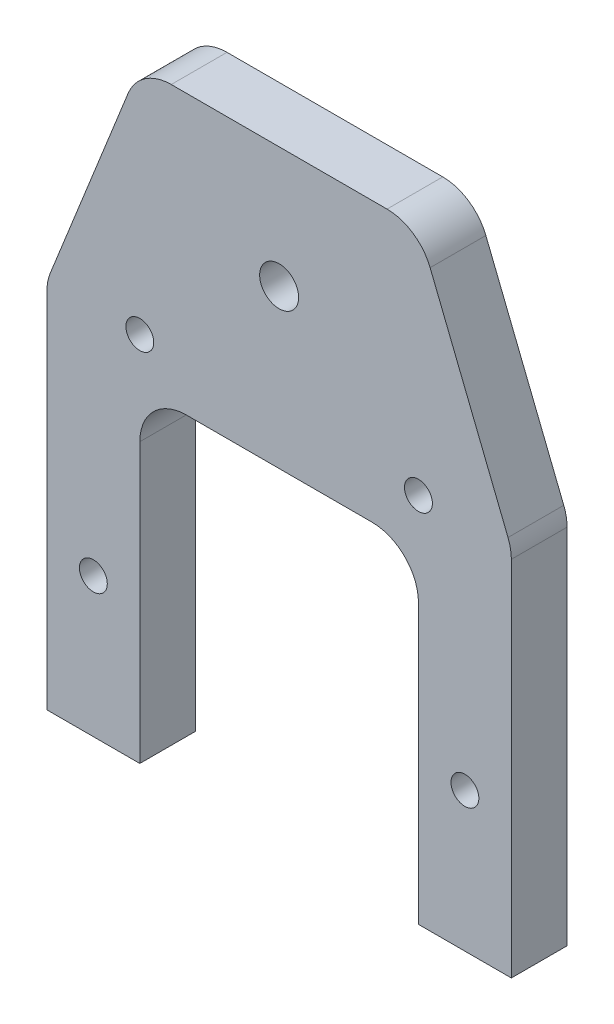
ISO-10303-21;
HEADER;
FILE_DESCRIPTION(('STEP AP214'),'2;1');
FILE_NAME('part.step','',(''),(''),'','','');
FILE_SCHEMA(('AUTOMOTIVE_DESIGN { 1 0 10303 214 1 1 1 1 }'));
ENDSEC;
DATA;
#1=APPLICATION_CONTEXT('core data for automotive mechanical design processes');
#2=APPLICATION_PROTOCOL_DEFINITION('international standard','automotive_design',2000,#1);
#3=PRODUCT_CONTEXT('',#1,'mechanical');
#4=PRODUCT('Part','Part','',(#3));
#5=PRODUCT_RELATED_PRODUCT_CATEGORY('part','',(#4));
#6=PRODUCT_DEFINITION_FORMATION('','',#4);
#7=PRODUCT_DEFINITION_CONTEXT('part definition',#1,'design');
#8=PRODUCT_DEFINITION('design','',#6,#7);
#9=PRODUCT_DEFINITION_SHAPE('','',#8);
#10=(LENGTH_UNIT() NAMED_UNIT(*) SI_UNIT(.MILLI.,.METRE.));
#11=(NAMED_UNIT(*) PLANE_ANGLE_UNIT() SI_UNIT($,.RADIAN.));
#12=(NAMED_UNIT(*) SI_UNIT($,.STERADIAN.) SOLID_ANGLE_UNIT());
#13=UNCERTAINTY_MEASURE_WITH_UNIT(LENGTH_MEASURE(1.E-05),#10,'distance_accuracy_value','');
#14=(GEOMETRIC_REPRESENTATION_CONTEXT(3) GLOBAL_UNCERTAINTY_ASSIGNED_CONTEXT((#13)) GLOBAL_UNIT_ASSIGNED_CONTEXT((#10,
#11,#12)) REPRESENTATION_CONTEXT('',''));
#15=CARTESIAN_POINT('',(0.,0.,0.));
#16=DIRECTION('',(0.,0.,1.));
#17=DIRECTION('',(1.,0.,0.));
#18=AXIS2_PLACEMENT_3D('',#15,#16,#17);
#19=CARTESIAN_POINT('',(50.,0.,6.));
#20=DIRECTION('',(0.,1.,0.));
#21=DIRECTION('',(0.,0.,1.));
#22=AXIS2_PLACEMENT_3D('',#19,#20,#21);
#23=PLANE('',#22);
#24=DIRECTION('',(1.,0.,0.));
#25=VECTOR('',#24,1.);
#26=CARTESIAN_POINT('',(50.,0.,6.));
#27=LINE('',#26,#25);
#28=CARTESIAN_POINT('',(40.,0.,6.));
#29=VERTEX_POINT('',#28);
#30=CARTESIAN_POINT('',(50.,0.,6.));
#31=VERTEX_POINT('',#30);
#32=EDGE_CURVE('E232',#29,#31,#27,.T.);
#33=ORIENTED_EDGE('',*,*,#32,.F.);
#34=DIRECTION('',(0.,0.,-1.));
#35=VECTOR('',#34,1.);
#36=CARTESIAN_POINT('',(40.,0.,6.));
#37=LINE('',#36,#35);
#38=CARTESIAN_POINT('',(40.,0.,0.));
#39=VERTEX_POINT('',#38);
#40=EDGE_CURVE('E156',#29,#39,#37,.T.);
#41=ORIENTED_EDGE('',*,*,#40,.T.);
#42=DIRECTION('',(1.,0.,0.));
#43=VECTOR('',#42,1.);
#44=CARTESIAN_POINT('',(50.,0.,0.));
#45=LINE('',#44,#43);
#46=CARTESIAN_POINT('',(50.,0.,0.));
#47=VERTEX_POINT('',#46);
#48=EDGE_CURVE('E210',#39,#47,#45,.T.);
#49=ORIENTED_EDGE('',*,*,#48,.T.);
#50=DIRECTION('',(0.,0.,-1.));
#51=VECTOR('',#50,1.);
#52=CARTESIAN_POINT('',(50.,0.,6.));
#53=LINE('',#52,#51);
#54=EDGE_CURVE('E279',#31,#47,#53,.T.);
#55=ORIENTED_EDGE('',*,*,#54,.F.);
#56=EDGE_LOOP('',(#33,#41,#49,#55));
#57=FACE_BOUND('',#56,.T.);
#58=ADVANCED_FACE('F26',(#57),#23,.F.);
#59=CARTESIAN_POINT('',(5.,39.0370879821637,6.));
#60=DIRECTION('',(0.,0.,-1.));
#61=DIRECTION('',(-1.,0.,0.));
#62=AXIS2_PLACEMENT_3D('',#59,#60,#61);
#63=PLANE('',#62);
#64=CARTESIAN_POINT('',(45.,15.,6.));
#65=DIRECTION('',(0.,0.,1.));
#66=DIRECTION('',(1.,0.,0.));
#67=AXIS2_PLACEMENT_3D('',#64,#65,#66);
#68=CIRCLE('',#67,1.5);
#69=CARTESIAN_POINT('',(46.5,15.,6.));
#70=VERTEX_POINT('',#69);
#71=EDGE_CURVE('E189',#70,#70,#68,.T.);
#72=ORIENTED_EDGE('',*,*,#71,.F.);
#73=EDGE_LOOP('',(#72));
#74=FACE_BOUND('',#73,.T.);
#75=CARTESIAN_POINT('',(40.,40.,6.));
#76=DIRECTION('',(0.,0.,1.));
#77=DIRECTION('',(1.,0.,0.));
#78=AXIS2_PLACEMENT_3D('',#75,#76,#77);
#79=CIRCLE('',#78,1.5);
#80=CARTESIAN_POINT('',(41.5,40.,6.));
#81=VERTEX_POINT('',#80);
#82=EDGE_CURVE('E201',#81,#81,#79,.T.);
#83=ORIENTED_EDGE('',*,*,#82,.F.);
#84=EDGE_LOOP('',(#83));
#85=FACE_BOUND('',#84,.T.);
#86=CARTESIAN_POINT('',(35.,30.,6.));
#87=DIRECTION('',(0.,0.,1.));
#88=DIRECTION('',(-1.,0.,0.));
#89=AXIS2_PLACEMENT_3D('',#86,#87,#88);
#90=CIRCLE('',#89,5.);
#91=CARTESIAN_POINT('',(40.,30.,6.));
#92=VERTEX_POINT('',#91);
#93=CARTESIAN_POINT('',(35.,35.,6.));
#94=VERTEX_POINT('',#93);
#95=EDGE_CURVE('E144',#92,#94,#90,.T.);
#96=ORIENTED_EDGE('',*,*,#95,.F.);
#97=DIRECTION('',(0.,1.,0.));
#98=VECTOR('',#97,1.);
#99=CARTESIAN_POINT('',(40.,30.,6.));
#100=LINE('',#99,#98);
#101=EDGE_CURVE('E153',#29,#92,#100,.T.);
#102=ORIENTED_EDGE('',*,*,#101,.F.);
#103=ORIENTED_EDGE('',*,*,#32,.T.);
#104=DIRECTION('',(0.,1.,0.));
#105=VECTOR('',#104,1.);
#106=CARTESIAN_POINT('',(50.,39.0370879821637,6.));
#107=LINE('',#106,#105);
#108=CARTESIAN_POINT('',(50.,39.0370879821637,6.));
#109=VERTEX_POINT('',#108);
#110=EDGE_CURVE('E235',#31,#109,#107,.T.);
#111=ORIENTED_EDGE('',*,*,#110,.T.);
#112=CARTESIAN_POINT('',(45.,39.0370879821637,6.));
#113=DIRECTION('',(0.,0.,1.));
#114=DIRECTION('',(-1.,0.,0.));
#115=AXIS2_PLACEMENT_3D('',#112,#113,#114);
#116=CIRCLE('',#115,5.);
#117=CARTESIAN_POINT('',(49.6423834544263,40.8940413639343,6.));
#118=VERTEX_POINT('',#117);
#119=EDGE_CURVE('E237',#109,#118,#116,.T.);
#120=ORIENTED_EDGE('',*,*,#119,.T.);
#121=DIRECTION('',(-0.371390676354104,0.928476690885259,0.));
#122=VECTOR('',#121,1.);
#123=CARTESIAN_POINT('',(41.2572186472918,61.8569533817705,6.));
#124=LINE('',#123,#122);
#125=CARTESIAN_POINT('',(41.2572186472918,61.8569533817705,6.));
#126=VERTEX_POINT('',#125);
#127=EDGE_CURVE('E239',#118,#126,#124,.T.);
#128=ORIENTED_EDGE('',*,*,#127,.T.);
#129=CARTESIAN_POINT('',(36.6148351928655,60.,6.));
#130=DIRECTION('',(0.,0.,1.));
#131=DIRECTION('',(-1.,0.,0.));
#132=AXIS2_PLACEMENT_3D('',#129,#130,#131);
#133=CIRCLE('',#132,5.);
#134=CARTESIAN_POINT('',(36.6148351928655,65.,6.));
#135=VERTEX_POINT('',#134);
#136=EDGE_CURVE('E241',#126,#135,#133,.T.);
#137=ORIENTED_EDGE('',*,*,#136,.T.);
#138=DIRECTION('',(-1.,0.,0.));
#139=VECTOR('',#138,1.);
#140=CARTESIAN_POINT('',(13.3851648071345,65.,6.));
#141=LINE('',#140,#139);
#142=CARTESIAN_POINT('',(13.3851648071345,65.,6.));
#143=VERTEX_POINT('',#142);
#144=EDGE_CURVE('E243',#135,#143,#141,.T.);
#145=ORIENTED_EDGE('',*,*,#144,.T.);
#146=CARTESIAN_POINT('',(13.3851648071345,60.,6.));
#147=DIRECTION('',(0.,0.,1.));
#148=DIRECTION('',(-1.,0.,0.));
#149=AXIS2_PLACEMENT_3D('',#146,#147,#148);
#150=CIRCLE('',#149,5.);
#151=CARTESIAN_POINT('',(8.7427813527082,61.8569533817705,6.));
#152=VERTEX_POINT('',#151);
#153=EDGE_CURVE('E245',#143,#152,#150,.T.);
#154=ORIENTED_EDGE('',*,*,#153,.T.);
#155=DIRECTION('',(-0.371390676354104,-0.928476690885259,0.));
#156=VECTOR('',#155,1.);
#157=CARTESIAN_POINT('',(0.35761654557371,40.8940413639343,6.));
#158=LINE('',#157,#156);
#159=CARTESIAN_POINT('',(0.357616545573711,40.8940413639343,6.));
#160=VERTEX_POINT('',#159);
#161=EDGE_CURVE('E247',#152,#160,#158,.T.);
#162=ORIENTED_EDGE('',*,*,#161,.T.);
#163=CARTESIAN_POINT('',(5.,39.0370879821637,6.));
#164=DIRECTION('',(0.,0.,1.));
#165=DIRECTION('',(-1.,0.,0.));
#166=AXIS2_PLACEMENT_3D('',#163,#164,#165);
#167=CIRCLE('',#166,5.);
#168=CARTESIAN_POINT('',(0.,39.0370879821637,6.));
#169=VERTEX_POINT('',#168);
#170=EDGE_CURVE('E249',#160,#169,#167,.T.);
#171=ORIENTED_EDGE('',*,*,#170,.T.);
#172=DIRECTION('',(0.,-1.,0.));
#173=VECTOR('',#172,1.);
#174=CARTESIAN_POINT('',(0.,0.,6.));
#175=LINE('',#174,#173);
#176=CARTESIAN_POINT('',(0.,0.,6.));
#177=VERTEX_POINT('',#176);
#178=EDGE_CURVE('E49',#169,#177,#175,.T.);
#179=ORIENTED_EDGE('',*,*,#178,.T.);
#180=CARTESIAN_POINT('',(10.,0.,6.));
#181=VERTEX_POINT('',#180);
#182=EDGE_CURVE('E233',#177,#181,#27,.T.);
#183=ORIENTED_EDGE('',*,*,#182,.T.);
#184=DIRECTION('',(0.,-1.,0.));
#185=VECTOR('',#184,1.);
#186=CARTESIAN_POINT('',(10.,30.,6.));
#187=LINE('',#186,#185);
#188=CARTESIAN_POINT('',(10.,30.,6.));
#189=VERTEX_POINT('',#188);
#190=EDGE_CURVE('E41',#189,#181,#187,.T.);
#191=ORIENTED_EDGE('',*,*,#190,.F.);
#192=CARTESIAN_POINT('',(15.,30.,6.));
#193=DIRECTION('',(0.,0.,1.));
#194=DIRECTION('',(1.,0.,0.));
#195=AXIS2_PLACEMENT_3D('',#192,#193,#194);
#196=CIRCLE('',#195,5.);
#197=CARTESIAN_POINT('',(15.,35.,6.));
#198=VERTEX_POINT('',#197);
#199=EDGE_CURVE('E165',#198,#189,#196,.T.);
#200=ORIENTED_EDGE('',*,*,#199,.F.);
#201=DIRECTION('',(-1.,0.,0.));
#202=VECTOR('',#201,1.);
#203=CARTESIAN_POINT('',(15.,35.,6.));
#204=LINE('',#203,#202);
#205=EDGE_CURVE('E163',#94,#198,#204,.T.);
#206=ORIENTED_EDGE('',*,*,#205,.F.);
#207=EDGE_LOOP('',(#96,#102,#103,#111,#120,#128,#137,#145,#154,#162,#171,#179,#183,#191,#200,#206));
#208=FACE_BOUND('',#207,.T.);
#209=CARTESIAN_POINT('',(10.,40.,6.));
#210=DIRECTION('',(0.,0.,1.));
#211=DIRECTION('',(1.,0.,0.));
#212=AXIS2_PLACEMENT_3D('',#209,#210,#211);
#213=CIRCLE('',#212,1.5);
#214=CARTESIAN_POINT('',(11.5,40.,6.));
#215=VERTEX_POINT('',#214);
#216=EDGE_CURVE('E207',#215,#215,#213,.T.);
#217=ORIENTED_EDGE('',*,*,#216,.F.);
#218=EDGE_LOOP('',(#217));
#219=FACE_BOUND('',#218,.T.);
#220=CARTESIAN_POINT('',(5.,15.,6.));
#221=DIRECTION('',(0.,0.,1.));
#222=DIRECTION('',(1.,0.,0.));
#223=AXIS2_PLACEMENT_3D('',#220,#221,#222);
#224=CIRCLE('',#223,1.5);
#225=CARTESIAN_POINT('',(6.5,15.,6.));
#226=VERTEX_POINT('',#225);
#227=EDGE_CURVE('E195',#226,#226,#224,.T.);
#228=ORIENTED_EDGE('',*,*,#227,.F.);
#229=EDGE_LOOP('',(#228));
#230=FACE_BOUND('',#229,.T.);
#231=CARTESIAN_POINT('',(25.,52.,6.));
#232=DIRECTION('',(0.,0.,1.));
#233=DIRECTION('',(1.,0.,0.));
#234=AXIS2_PLACEMENT_3D('',#231,#232,#233);
#235=CIRCLE('',#234,2.1);
#236=CARTESIAN_POINT('',(27.1,52.,6.));
#237=VERTEX_POINT('',#236);
#238=EDGE_CURVE('E183',#237,#237,#235,.T.);
#239=ORIENTED_EDGE('',*,*,#238,.F.);
#240=EDGE_LOOP('',(#239));
#241=FACE_BOUND('',#240,.T.);
#242=ADVANCED_FACE('F159',(#74,#85,#208,#219,#230,#241),#63,.F.);
#243=CARTESIAN_POINT('',(5.,39.0370879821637,0.));
#244=DIRECTION('',(0.,0.,-1.));
#245=DIRECTION('',(-1.,0.,0.));
#246=AXIS2_PLACEMENT_3D('',#243,#244,#245);
#247=PLANE('',#246);
#248=DIRECTION('',(0.,-1.,0.));
#249=VECTOR('',#248,1.);
#250=CARTESIAN_POINT('',(40.,39.0370879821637,0.));
#251=LINE('',#250,#249);
#252=CARTESIAN_POINT('',(40.,30.,0.));
#253=VERTEX_POINT('',#252);
#254=EDGE_CURVE('E178',#253,#39,#251,.T.);
#255=ORIENTED_EDGE('',*,*,#254,.F.);
#256=CARTESIAN_POINT('',(35.,30.,0.));
#257=DIRECTION('',(0.,0.,-1.));
#258=DIRECTION('',(-1.,0.,0.));
#259=AXIS2_PLACEMENT_3D('',#256,#257,#258);
#260=CIRCLE('',#259,5.);
#261=CARTESIAN_POINT('',(35.,35.,0.));
#262=VERTEX_POINT('',#261);
#263=EDGE_CURVE('E147',#262,#253,#260,.T.);
#264=ORIENTED_EDGE('',*,*,#263,.F.);
#265=DIRECTION('',(1.,0.,0.));
#266=VECTOR('',#265,1.);
#267=CARTESIAN_POINT('',(5.,35.,0.));
#268=LINE('',#267,#266);
#269=CARTESIAN_POINT('',(15.,35.,0.));
#270=VERTEX_POINT('',#269);
#271=EDGE_CURVE('E34',#270,#262,#268,.T.);
#272=ORIENTED_EDGE('',*,*,#271,.F.);
#273=CARTESIAN_POINT('',(15.,30.,0.));
#274=DIRECTION('',(0.,0.,-1.));
#275=DIRECTION('',(-1.,0.,0.));
#276=AXIS2_PLACEMENT_3D('',#273,#274,#275);
#277=CIRCLE('',#276,5.);
#278=CARTESIAN_POINT('',(10.,30.,0.));
#279=VERTEX_POINT('',#278);
#280=EDGE_CURVE('E11',#279,#270,#277,.T.);
#281=ORIENTED_EDGE('',*,*,#280,.F.);
#282=DIRECTION('',(0.,1.,0.));
#283=VECTOR('',#282,1.);
#284=CARTESIAN_POINT('',(10.,39.0370879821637,0.));
#285=LINE('',#284,#283);
#286=CARTESIAN_POINT('',(10.,0.,0.));
#287=VERTEX_POINT('',#286);
#288=EDGE_CURVE('E173',#287,#279,#285,.T.);
#289=ORIENTED_EDGE('',*,*,#288,.F.);
#290=CARTESIAN_POINT('',(0.,0.,0.));
#291=VERTEX_POINT('',#290);
#292=EDGE_CURVE('E211',#291,#287,#45,.T.);
#293=ORIENTED_EDGE('',*,*,#292,.F.);
#294=DIRECTION('',(0.,-1.,0.));
#295=VECTOR('',#294,1.);
#296=CARTESIAN_POINT('',(0.,0.,0.));
#297=LINE('',#296,#295);
#298=CARTESIAN_POINT('',(0.,39.0370879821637,0.));
#299=VERTEX_POINT('',#298);
#300=EDGE_CURVE('E230',#299,#291,#297,.T.);
#301=ORIENTED_EDGE('',*,*,#300,.F.);
#302=CARTESIAN_POINT('',(5.,39.0370879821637,0.));
#303=DIRECTION('',(0.,0.,1.));
#304=DIRECTION('',(-1.,0.,0.));
#305=AXIS2_PLACEMENT_3D('',#302,#303,#304);
#306=CIRCLE('',#305,5.);
#307=CARTESIAN_POINT('',(0.357616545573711,40.8940413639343,0.));
#308=VERTEX_POINT('',#307);
#309=EDGE_CURVE('E228',#308,#299,#306,.T.);
#310=ORIENTED_EDGE('',*,*,#309,.F.);
#311=DIRECTION('',(-0.371390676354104,-0.928476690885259,0.));
#312=VECTOR('',#311,1.);
#313=CARTESIAN_POINT('',(0.35761654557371,40.8940413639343,0.));
#314=LINE('',#313,#312);
#315=CARTESIAN_POINT('',(8.7427813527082,61.8569533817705,0.));
#316=VERTEX_POINT('',#315);
#317=EDGE_CURVE('E226',#316,#308,#314,.T.);
#318=ORIENTED_EDGE('',*,*,#317,.F.);
#319=CARTESIAN_POINT('',(13.3851648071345,60.,0.));
#320=DIRECTION('',(0.,0.,1.));
#321=DIRECTION('',(-1.,0.,0.));
#322=AXIS2_PLACEMENT_3D('',#319,#320,#321);
#323=CIRCLE('',#322,5.);
#324=CARTESIAN_POINT('',(13.3851648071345,65.,0.));
#325=VERTEX_POINT('',#324);
#326=EDGE_CURVE('E224',#325,#316,#323,.T.);
#327=ORIENTED_EDGE('',*,*,#326,.F.);
#328=DIRECTION('',(-1.,0.,0.));
#329=VECTOR('',#328,1.);
#330=CARTESIAN_POINT('',(13.3851648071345,65.,0.));
#331=LINE('',#330,#329);
#332=CARTESIAN_POINT('',(36.6148351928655,65.,0.));
#333=VERTEX_POINT('',#332);
#334=EDGE_CURVE('E222',#333,#325,#331,.T.);
#335=ORIENTED_EDGE('',*,*,#334,.F.);
#336=CARTESIAN_POINT('',(36.6148351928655,60.,0.));
#337=DIRECTION('',(0.,0.,1.));
#338=DIRECTION('',(-1.,0.,0.));
#339=AXIS2_PLACEMENT_3D('',#336,#337,#338);
#340=CIRCLE('',#339,5.);
#341=CARTESIAN_POINT('',(41.2572186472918,61.8569533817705,0.));
#342=VERTEX_POINT('',#341);
#343=EDGE_CURVE('E220',#342,#333,#340,.T.);
#344=ORIENTED_EDGE('',*,*,#343,.F.);
#345=DIRECTION('',(-0.371390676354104,0.928476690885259,0.));
#346=VECTOR('',#345,1.);
#347=CARTESIAN_POINT('',(41.2572186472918,61.8569533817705,0.));
#348=LINE('',#347,#346);
#349=CARTESIAN_POINT('',(49.6423834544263,40.8940413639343,0.));
#350=VERTEX_POINT('',#349);
#351=EDGE_CURVE('E218',#350,#342,#348,.T.);
#352=ORIENTED_EDGE('',*,*,#351,.F.);
#353=CARTESIAN_POINT('',(45.,39.0370879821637,0.));
#354=DIRECTION('',(0.,0.,1.));
#355=DIRECTION('',(-1.,0.,0.));
#356=AXIS2_PLACEMENT_3D('',#353,#354,#355);
#357=CIRCLE('',#356,5.);
#358=CARTESIAN_POINT('',(50.,39.0370879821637,0.));
#359=VERTEX_POINT('',#358);
#360=EDGE_CURVE('E216',#359,#350,#357,.T.);
#361=ORIENTED_EDGE('',*,*,#360,.F.);
#362=DIRECTION('',(0.,1.,0.));
#363=VECTOR('',#362,1.);
#364=CARTESIAN_POINT('',(50.,39.0370879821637,0.));
#365=LINE('',#364,#363);
#366=EDGE_CURVE('E214',#47,#359,#365,.T.);
#367=ORIENTED_EDGE('',*,*,#366,.F.);
#368=ORIENTED_EDGE('',*,*,#48,.F.);
#369=EDGE_LOOP('',(#255,#264,#272,#281,#289,#293,#301,#310,#318,#327,#335,#344,#352,#361,#367,#368));
#370=FACE_BOUND('',#369,.T.);
#371=CARTESIAN_POINT('',(45.,15.,0.));
#372=DIRECTION('',(0.,0.,1.));
#373=DIRECTION('',(1.,0.,0.));
#374=AXIS2_PLACEMENT_3D('',#371,#372,#373);
#375=CIRCLE('',#374,1.5);
#376=CARTESIAN_POINT('',(46.5,15.,0.));
#377=VERTEX_POINT('',#376);
#378=EDGE_CURVE('E186',#377,#377,#375,.T.);
#379=ORIENTED_EDGE('',*,*,#378,.T.);
#380=EDGE_LOOP('',(#379));
#381=FACE_BOUND('',#380,.T.);
#382=CARTESIAN_POINT('',(40.,40.,0.));
#383=DIRECTION('',(0.,0.,1.));
#384=DIRECTION('',(1.,0.,0.));
#385=AXIS2_PLACEMENT_3D('',#382,#383,#384);
#386=CIRCLE('',#385,1.5);
#387=CARTESIAN_POINT('',(41.5,40.,0.));
#388=VERTEX_POINT('',#387);
#389=EDGE_CURVE('E198',#388,#388,#386,.T.);
#390=ORIENTED_EDGE('',*,*,#389,.T.);
#391=EDGE_LOOP('',(#390));
#392=FACE_BOUND('',#391,.T.);
#393=CARTESIAN_POINT('',(10.,40.,0.));
#394=DIRECTION('',(0.,0.,1.));
#395=DIRECTION('',(1.,0.,0.));
#396=AXIS2_PLACEMENT_3D('',#393,#394,#395);
#397=CIRCLE('',#396,1.5);
#398=CARTESIAN_POINT('',(11.5,40.,0.));
#399=VERTEX_POINT('',#398);
#400=EDGE_CURVE('E204',#399,#399,#397,.T.);
#401=ORIENTED_EDGE('',*,*,#400,.T.);
#402=EDGE_LOOP('',(#401));
#403=FACE_BOUND('',#402,.T.);
#404=CARTESIAN_POINT('',(5.,15.,0.));
#405=DIRECTION('',(0.,0.,1.));
#406=DIRECTION('',(1.,0.,0.));
#407=AXIS2_PLACEMENT_3D('',#404,#405,#406);
#408=CIRCLE('',#407,1.5);
#409=CARTESIAN_POINT('',(6.5,15.,0.));
#410=VERTEX_POINT('',#409);
#411=EDGE_CURVE('E192',#410,#410,#408,.T.);
#412=ORIENTED_EDGE('',*,*,#411,.T.);
#413=EDGE_LOOP('',(#412));
#414=FACE_BOUND('',#413,.T.);
#415=CARTESIAN_POINT('',(25.,52.,0.));
#416=DIRECTION('',(0.,0.,1.));
#417=DIRECTION('',(1.,0.,0.));
#418=AXIS2_PLACEMENT_3D('',#415,#416,#417);
#419=CIRCLE('',#418,2.1);
#420=CARTESIAN_POINT('',(27.1,52.,0.));
#421=VERTEX_POINT('',#420);
#422=EDGE_CURVE('E180',#421,#421,#419,.T.);
#423=ORIENTED_EDGE('',*,*,#422,.T.);
#424=EDGE_LOOP('',(#423));
#425=FACE_BOUND('',#424,.T.);
#426=ADVANCED_FACE('F291',(#370,#381,#392,#403,#414,#425),#247,.T.);
#427=ORIENTED_EDGE('',*,*,#292,.T.);
#428=DIRECTION('',(0.,0.,1.));
#429=VECTOR('',#428,1.);
#430=CARTESIAN_POINT('',(10.,0.,6.));
#431=LINE('',#430,#429);
#432=EDGE_CURVE('E282',#287,#181,#431,.T.);
#433=ORIENTED_EDGE('',*,*,#432,.T.);
#434=ORIENTED_EDGE('',*,*,#182,.F.);
#435=DIRECTION('',(0.,0.,-1.));
#436=VECTOR('',#435,1.);
#437=CARTESIAN_POINT('',(0.,0.,6.));
#438=LINE('',#437,#436);
#439=EDGE_CURVE('E252',#177,#291,#438,.T.);
#440=ORIENTED_EDGE('',*,*,#439,.T.);
#441=EDGE_LOOP('',(#427,#433,#434,#440));
#442=FACE_BOUND('',#441,.T.);
#443=ADVANCED_FACE('F28',(#442),#23,.F.);
#444=CARTESIAN_POINT('',(50.,39.0370879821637,6.));
#445=DIRECTION('',(-1.,0.,0.));
#446=DIRECTION('',(0.,0.,1.));
#447=AXIS2_PLACEMENT_3D('',#444,#445,#446);
#448=PLANE('',#447);
#449=ORIENTED_EDGE('',*,*,#366,.T.);
#450=DIRECTION('',(0.,0.,-1.));
#451=VECTOR('',#450,1.);
#452=CARTESIAN_POINT('',(50.,39.0370879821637,6.));
#453=LINE('',#452,#451);
#454=EDGE_CURVE('E276',#109,#359,#453,.T.);
#455=ORIENTED_EDGE('',*,*,#454,.F.);
#456=ORIENTED_EDGE('',*,*,#110,.F.);
#457=ORIENTED_EDGE('',*,*,#54,.T.);
#458=EDGE_LOOP('',(#449,#455,#456,#457));
#459=FACE_BOUND('',#458,.T.);
#460=ADVANCED_FACE('F300',(#459),#448,.F.);
#461=CARTESIAN_POINT('',(45.,39.0370879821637,6.));
#462=DIRECTION('',(0.,0.,-1.));
#463=DIRECTION('',(-1.,0.,0.));
#464=AXIS2_PLACEMENT_3D('',#461,#462,#463);
#465=CYLINDRICAL_SURFACE('',#464,5.);
#466=ORIENTED_EDGE('',*,*,#360,.T.);
#467=DIRECTION('',(0.,0.,-1.));
#468=VECTOR('',#467,1.);
#469=CARTESIAN_POINT('',(49.6423834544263,40.8940413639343,6.));
#470=LINE('',#469,#468);
#471=EDGE_CURVE('E273',#118,#350,#470,.T.);
#472=ORIENTED_EDGE('',*,*,#471,.F.);
#473=ORIENTED_EDGE('',*,*,#119,.F.);
#474=ORIENTED_EDGE('',*,*,#454,.T.);
#475=EDGE_LOOP('',(#466,#472,#473,#474));
#476=FACE_BOUND('',#475,.T.);
#477=ADVANCED_FACE('F305',(#476),#465,.T.);
#478=CARTESIAN_POINT('',(41.2572186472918,61.8569533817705,6.));
#479=DIRECTION('',(-0.928476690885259,-0.371390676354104,0.));
#480=DIRECTION('',(0.371390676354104,-0.928476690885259,0.));
#481=AXIS2_PLACEMENT_3D('',#478,#479,#480);
#482=PLANE('',#481);
#483=ORIENTED_EDGE('',*,*,#351,.T.);
#484=DIRECTION('',(0.,0.,-1.));
#485=VECTOR('',#484,1.);
#486=CARTESIAN_POINT('',(41.2572186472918,61.8569533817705,6.));
#487=LINE('',#486,#485);
#488=EDGE_CURVE('E270',#126,#342,#487,.T.);
#489=ORIENTED_EDGE('',*,*,#488,.F.);
#490=ORIENTED_EDGE('',*,*,#127,.F.);
#491=ORIENTED_EDGE('',*,*,#471,.T.);
#492=EDGE_LOOP('',(#483,#489,#490,#491));
#493=FACE_BOUND('',#492,.T.);
#494=ADVANCED_FACE('F311',(#493),#482,.F.);
#495=CARTESIAN_POINT('',(36.6148351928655,60.,6.));
#496=DIRECTION('',(0.,0.,-1.));
#497=DIRECTION('',(-1.,0.,0.));
#498=AXIS2_PLACEMENT_3D('',#495,#496,#497);
#499=CYLINDRICAL_SURFACE('',#498,5.);
#500=ORIENTED_EDGE('',*,*,#343,.T.);
#501=DIRECTION('',(0.,0.,-1.));
#502=VECTOR('',#501,1.);
#503=CARTESIAN_POINT('',(36.6148351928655,65.,6.));
#504=LINE('',#503,#502);
#505=EDGE_CURVE('E267',#135,#333,#504,.T.);
#506=ORIENTED_EDGE('',*,*,#505,.F.);
#507=ORIENTED_EDGE('',*,*,#136,.F.);
#508=ORIENTED_EDGE('',*,*,#488,.T.);
#509=EDGE_LOOP('',(#500,#506,#507,#508));
#510=FACE_BOUND('',#509,.T.);
#511=ADVANCED_FACE('F315',(#510),#499,.T.);
#512=CARTESIAN_POINT('',(13.3851648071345,65.,6.));
#513=DIRECTION('',(0.,-1.,0.));
#514=DIRECTION('',(0.,0.,-1.));
#515=AXIS2_PLACEMENT_3D('',#512,#513,#514);
#516=PLANE('',#515);
#517=ORIENTED_EDGE('',*,*,#334,.T.);
#518=DIRECTION('',(0.,0.,-1.));
#519=VECTOR('',#518,1.);
#520=CARTESIAN_POINT('',(13.3851648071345,65.,6.));
#521=LINE('',#520,#519);
#522=EDGE_CURVE('E264',#143,#325,#521,.T.);
#523=ORIENTED_EDGE('',*,*,#522,.F.);
#524=ORIENTED_EDGE('',*,*,#144,.F.);
#525=ORIENTED_EDGE('',*,*,#505,.T.);
#526=EDGE_LOOP('',(#517,#523,#524,#525));
#527=FACE_BOUND('',#526,.T.);
#528=ADVANCED_FACE('F320',(#527),#516,.F.);
#529=CARTESIAN_POINT('',(13.3851648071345,60.,6.));
#530=DIRECTION('',(0.,0.,-1.));
#531=DIRECTION('',(-1.,0.,0.));
#532=AXIS2_PLACEMENT_3D('',#529,#530,#531);
#533=CYLINDRICAL_SURFACE('',#532,5.);
#534=ORIENTED_EDGE('',*,*,#326,.T.);
#535=DIRECTION('',(0.,0.,-1.));
#536=VECTOR('',#535,1.);
#537=CARTESIAN_POINT('',(8.7427813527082,61.8569533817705,6.));
#538=LINE('',#537,#536);
#539=EDGE_CURVE('E261',#152,#316,#538,.T.);
#540=ORIENTED_EDGE('',*,*,#539,.F.);
#541=ORIENTED_EDGE('',*,*,#153,.F.);
#542=ORIENTED_EDGE('',*,*,#522,.T.);
#543=EDGE_LOOP('',(#534,#540,#541,#542));
#544=FACE_BOUND('',#543,.T.);
#545=ADVANCED_FACE('F326',(#544),#533,.T.);
#546=CARTESIAN_POINT('',(0.35761654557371,40.8940413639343,6.));
#547=DIRECTION('',(0.928476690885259,-0.371390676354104,0.));
#548=DIRECTION('',(0.371390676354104,0.928476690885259,0.));
#549=AXIS2_PLACEMENT_3D('',#546,#547,#548);
#550=PLANE('',#549);
#551=ORIENTED_EDGE('',*,*,#317,.T.);
#552=DIRECTION('',(0.,0.,-1.));
#553=VECTOR('',#552,1.);
#554=CARTESIAN_POINT('',(0.357616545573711,40.8940413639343,6.));
#555=LINE('',#554,#553);
#556=EDGE_CURVE('E258',#160,#308,#555,.T.);
#557=ORIENTED_EDGE('',*,*,#556,.F.);
#558=ORIENTED_EDGE('',*,*,#161,.F.);
#559=ORIENTED_EDGE('',*,*,#539,.T.);
#560=EDGE_LOOP('',(#551,#557,#558,#559));
#561=FACE_BOUND('',#560,.T.);
#562=ADVANCED_FACE('F330',(#561),#550,.F.);
#563=CARTESIAN_POINT('',(5.,39.0370879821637,6.));
#564=DIRECTION('',(0.,0.,-1.));
#565=DIRECTION('',(-1.,0.,0.));
#566=AXIS2_PLACEMENT_3D('',#563,#564,#565);
#567=CYLINDRICAL_SURFACE('',#566,5.);
#568=ORIENTED_EDGE('',*,*,#309,.T.);
#569=DIRECTION('',(0.,0.,-1.));
#570=VECTOR('',#569,1.);
#571=CARTESIAN_POINT('',(0.,39.0370879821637,6.));
#572=LINE('',#571,#570);
#573=EDGE_CURVE('E255',#169,#299,#572,.T.);
#574=ORIENTED_EDGE('',*,*,#573,.F.);
#575=ORIENTED_EDGE('',*,*,#170,.F.);
#576=ORIENTED_EDGE('',*,*,#556,.T.);
#577=EDGE_LOOP('',(#568,#574,#575,#576));
#578=FACE_BOUND('',#577,.T.);
#579=ADVANCED_FACE('F335',(#578),#567,.T.);
#580=CARTESIAN_POINT('',(0.,0.,6.));
#581=DIRECTION('',(1.,0.,0.));
#582=DIRECTION('',(0.,0.,-1.));
#583=AXIS2_PLACEMENT_3D('',#580,#581,#582);
#584=PLANE('',#583);
#585=ORIENTED_EDGE('',*,*,#300,.T.);
#586=ORIENTED_EDGE('',*,*,#439,.F.);
#587=ORIENTED_EDGE('',*,*,#178,.F.);
#588=ORIENTED_EDGE('',*,*,#573,.T.);
#589=EDGE_LOOP('',(#585,#586,#587,#588));
#590=FACE_BOUND('',#589,.T.);
#591=ADVANCED_FACE('F338',(#590),#584,.F.);
#592=CARTESIAN_POINT('',(10.,40.,6.));
#593=DIRECTION('',(0.,0.,-1.));
#594=DIRECTION('',(-1.,0.,0.));
#595=AXIS2_PLACEMENT_3D('',#592,#593,#594);
#596=CYLINDRICAL_SURFACE('',#595,1.5);
#597=ORIENTED_EDGE('',*,*,#216,.T.);
#598=EDGE_LOOP('',(#597));
#599=FACE_BOUND('',#598,.T.);
#600=ORIENTED_EDGE('',*,*,#400,.F.);
#601=EDGE_LOOP('',(#600));
#602=FACE_BOUND('',#601,.T.);
#603=ADVANCED_FACE('F372',(#599,#602),#596,.F.);
#604=CARTESIAN_POINT('',(40.,40.,6.));
#605=DIRECTION('',(0.,0.,-1.));
#606=DIRECTION('',(-1.,0.,0.));
#607=AXIS2_PLACEMENT_3D('',#604,#605,#606);
#608=CYLINDRICAL_SURFACE('',#607,1.5);
#609=ORIENTED_EDGE('',*,*,#82,.T.);
#610=EDGE_LOOP('',(#609));
#611=FACE_BOUND('',#610,.T.);
#612=ORIENTED_EDGE('',*,*,#389,.F.);
#613=EDGE_LOOP('',(#612));
#614=FACE_BOUND('',#613,.T.);
#615=ADVANCED_FACE('F428',(#611,#614),#608,.F.);
#616=CARTESIAN_POINT('',(5.,15.,6.));
#617=DIRECTION('',(0.,0.,-1.));
#618=DIRECTION('',(-1.,0.,0.));
#619=AXIS2_PLACEMENT_3D('',#616,#617,#618);
#620=CYLINDRICAL_SURFACE('',#619,1.5);
#621=ORIENTED_EDGE('',*,*,#227,.T.);
#622=EDGE_LOOP('',(#621));
#623=FACE_BOUND('',#622,.T.);
#624=ORIENTED_EDGE('',*,*,#411,.F.);
#625=EDGE_LOOP('',(#624));
#626=FACE_BOUND('',#625,.T.);
#627=ADVANCED_FACE('F435',(#623,#626),#620,.F.);
#628=CARTESIAN_POINT('',(45.,15.,6.));
#629=DIRECTION('',(0.,0.,-1.));
#630=DIRECTION('',(-1.,0.,0.));
#631=AXIS2_PLACEMENT_3D('',#628,#629,#630);
#632=CYLINDRICAL_SURFACE('',#631,1.5);
#633=ORIENTED_EDGE('',*,*,#71,.T.);
#634=EDGE_LOOP('',(#633));
#635=FACE_BOUND('',#634,.T.);
#636=ORIENTED_EDGE('',*,*,#378,.F.);
#637=EDGE_LOOP('',(#636));
#638=FACE_BOUND('',#637,.T.);
#639=ADVANCED_FACE('F442',(#635,#638),#632,.F.);
#640=CARTESIAN_POINT('',(25.,52.,6.));
#641=DIRECTION('',(0.,0.,-1.));
#642=DIRECTION('',(-1.,0.,0.));
#643=AXIS2_PLACEMENT_3D('',#640,#641,#642);
#644=CYLINDRICAL_SURFACE('',#643,2.1);
#645=ORIENTED_EDGE('',*,*,#238,.T.);
#646=EDGE_LOOP('',(#645));
#647=FACE_BOUND('',#646,.T.);
#648=ORIENTED_EDGE('',*,*,#422,.F.);
#649=EDGE_LOOP('',(#648));
#650=FACE_BOUND('',#649,.T.);
#651=ADVANCED_FACE('F354',(#647,#650),#644,.F.);
#652=CARTESIAN_POINT('',(40.,30.,-4.));
#653=DIRECTION('',(1.,0.,0.));
#654=DIRECTION('',(0.,0.,-1.));
#655=AXIS2_PLACEMENT_3D('',#652,#653,#654);
#656=PLANE('',#655);
#657=ORIENTED_EDGE('',*,*,#254,.T.);
#658=ORIENTED_EDGE('',*,*,#40,.F.);
#659=ORIENTED_EDGE('',*,*,#101,.T.);
#660=DIRECTION('',(0.,0.,1.));
#661=VECTOR('',#660,1.);
#662=CARTESIAN_POINT('',(40.,30.,-4.));
#663=LINE('',#662,#661);
#664=EDGE_CURVE('E139',#253,#92,#663,.T.);
#665=ORIENTED_EDGE('',*,*,#664,.F.);
#666=EDGE_LOOP('',(#657,#658,#659,#665));
#667=FACE_BOUND('',#666,.T.);
#668=ADVANCED_FACE('F154',(#667),#656,.F.);
#669=CARTESIAN_POINT('',(10.,30.,-4.));
#670=DIRECTION('',(-1.,0.,0.));
#671=DIRECTION('',(0.,0.,1.));
#672=AXIS2_PLACEMENT_3D('',#669,#670,#671);
#673=PLANE('',#672);
#674=ORIENTED_EDGE('',*,*,#288,.T.);
#675=DIRECTION('',(0.,0.,1.));
#676=VECTOR('',#675,1.);
#677=CARTESIAN_POINT('',(10.,30.,-4.));
#678=LINE('',#677,#676);
#679=EDGE_CURVE('E171',#279,#189,#678,.T.);
#680=ORIENTED_EDGE('',*,*,#679,.T.);
#681=ORIENTED_EDGE('',*,*,#190,.T.);
#682=ORIENTED_EDGE('',*,*,#432,.F.);
#683=EDGE_LOOP('',(#674,#680,#681,#682));
#684=FACE_BOUND('',#683,.T.);
#685=ADVANCED_FACE('F346',(#684),#673,.F.);
#686=CARTESIAN_POINT('',(15.,30.,-4.));
#687=DIRECTION('',(0.,0.,1.));
#688=DIRECTION('',(1.,0.,0.));
#689=AXIS2_PLACEMENT_3D('',#686,#687,#688);
#690=CYLINDRICAL_SURFACE('',#689,5.);
#691=ORIENTED_EDGE('',*,*,#280,.T.);
#692=DIRECTION('',(0.,0.,1.));
#693=VECTOR('',#692,1.);
#694=CARTESIAN_POINT('',(15.,35.,-4.));
#695=LINE('',#694,#693);
#696=EDGE_CURVE('E174',#270,#198,#695,.T.);
#697=ORIENTED_EDGE('',*,*,#696,.T.);
#698=ORIENTED_EDGE('',*,*,#199,.T.);
#699=ORIENTED_EDGE('',*,*,#679,.F.);
#700=EDGE_LOOP('',(#691,#697,#698,#699));
#701=FACE_BOUND('',#700,.T.);
#702=ADVANCED_FACE('F344',(#701),#690,.F.);
#703=CARTESIAN_POINT('',(15.,35.,-4.));
#704=DIRECTION('',(0.,1.,0.));
#705=DIRECTION('',(0.,0.,1.));
#706=AXIS2_PLACEMENT_3D('',#703,#704,#705);
#707=PLANE('',#706);
#708=ORIENTED_EDGE('',*,*,#271,.T.);
#709=DIRECTION('',(0.,0.,1.));
#710=VECTOR('',#709,1.);
#711=CARTESIAN_POINT('',(35.,35.,-4.));
#712=LINE('',#711,#710);
#713=EDGE_CURVE('E150',#262,#94,#712,.T.);
#714=ORIENTED_EDGE('',*,*,#713,.T.);
#715=ORIENTED_EDGE('',*,*,#205,.T.);
#716=ORIENTED_EDGE('',*,*,#696,.F.);
#717=EDGE_LOOP('',(#708,#714,#715,#716));
#718=FACE_BOUND('',#717,.T.);
#719=ADVANCED_FACE('F288',(#718),#707,.F.);
#720=CARTESIAN_POINT('',(35.,30.,-4.));
#721=DIRECTION('',(0.,0.,1.));
#722=DIRECTION('',(1.,0.,0.));
#723=AXIS2_PLACEMENT_3D('',#720,#721,#722);
#724=CYLINDRICAL_SURFACE('',#723,5.);
#725=ORIENTED_EDGE('',*,*,#263,.T.);
#726=ORIENTED_EDGE('',*,*,#664,.T.);
#727=ORIENTED_EDGE('',*,*,#95,.T.);
#728=ORIENTED_EDGE('',*,*,#713,.F.);
#729=EDGE_LOOP('',(#725,#726,#727,#728));
#730=FACE_BOUND('',#729,.T.);
#731=ADVANCED_FACE('F141',(#730),#724,.F.);
#732=CLOSED_SHELL('',(#58,#242,#426,#443,#460,#477,#494,#511,#528,#545,#562,#579,#591,#603,#615,
#627,#639,#651,#668,#685,#702,#719,#731));
#733=MANIFOLD_SOLID_BREP('B2',#732);
#734=ADVANCED_BREP_SHAPE_REPRESENTATION('',(#18,#733),#14);
#735=SHAPE_DEFINITION_REPRESENTATION(#9,#734);
ENDSEC;
END-ISO-10303-21;
